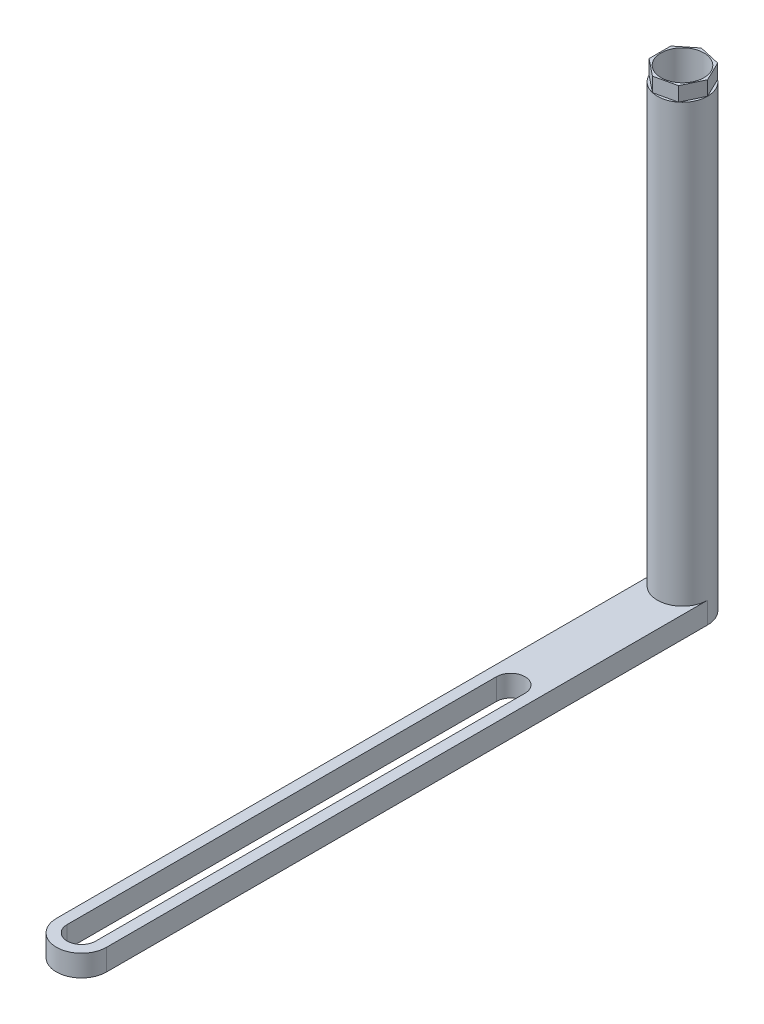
ISO-10303-21;
HEADER;
FILE_DESCRIPTION(('STEP AP214'),'2;1');
FILE_NAME('part.step','',(''),(''),'','','');
FILE_SCHEMA(('AUTOMOTIVE_DESIGN { 1 0 10303 214 1 1 1 1 }'));
ENDSEC;
DATA;
#1=APPLICATION_CONTEXT('core data for automotive mechanical design processes');
#2=APPLICATION_PROTOCOL_DEFINITION('international standard','automotive_design',2000,#1);
#3=PRODUCT_CONTEXT('',#1,'mechanical');
#4=PRODUCT('Part','Part','',(#3));
#5=PRODUCT_RELATED_PRODUCT_CATEGORY('part','',(#4));
#6=PRODUCT_DEFINITION_FORMATION('','',#4);
#7=PRODUCT_DEFINITION_CONTEXT('part definition',#1,'design');
#8=PRODUCT_DEFINITION('design','',#6,#7);
#9=PRODUCT_DEFINITION_SHAPE('','',#8);
#10=(LENGTH_UNIT() NAMED_UNIT(*) SI_UNIT(.MILLI.,.METRE.));
#11=(NAMED_UNIT(*) PLANE_ANGLE_UNIT() SI_UNIT($,.RADIAN.));
#12=(NAMED_UNIT(*) SI_UNIT($,.STERADIAN.) SOLID_ANGLE_UNIT());
#13=UNCERTAINTY_MEASURE_WITH_UNIT(LENGTH_MEASURE(1.E-05),#10,'distance_accuracy_value','');
#14=(GEOMETRIC_REPRESENTATION_CONTEXT(3) GLOBAL_UNCERTAINTY_ASSIGNED_CONTEXT((#13)) GLOBAL_UNIT_ASSIGNED_CONTEXT((#10,
#11,#12)) REPRESENTATION_CONTEXT('',''));
#15=CARTESIAN_POINT('',(0.,0.,0.));
#16=DIRECTION('',(0.,0.,1.));
#17=DIRECTION('',(1.,0.,0.));
#18=AXIS2_PLACEMENT_3D('',#15,#16,#17);
#19=CARTESIAN_POINT('',(0.,33.,0.));
#20=DIRECTION('',(0.,-1.,0.));
#21=DIRECTION('',(0.,0.,-1.));
#22=AXIS2_PLACEMENT_3D('',#19,#20,#21);
#23=CYLINDRICAL_SURFACE('',#22,1.75);
#24=CARTESIAN_POINT('',(0.,1.5,0.));
#25=DIRECTION('',(0.,-1.,0.));
#26=DIRECTION('',(0.,0.,-1.));
#27=AXIS2_PLACEMENT_3D('',#24,#25,#26);
#28=CIRCLE('',#27,1.75);
#29=CARTESIAN_POINT('',(1.75,1.5,0.));
#30=VERTEX_POINT('',#29);
#31=CARTESIAN_POINT('',(-1.75,1.5,0.));
#32=VERTEX_POINT('',#31);
#33=EDGE_CURVE('E61',#30,#32,#28,.T.);
#34=ORIENTED_EDGE('',*,*,#33,.F.);
#35=DIRECTION('',(0.,-1.,0.));
#36=VECTOR('',#35,1.);
#37=CARTESIAN_POINT('',(1.75,1.5,0.));
#38=LINE('',#37,#36);
#39=CARTESIAN_POINT('',(1.75,0.,0.));
#40=VERTEX_POINT('',#39);
#41=EDGE_CURVE('E236',#30,#40,#38,.T.);
#42=ORIENTED_EDGE('',*,*,#41,.T.);
#43=CARTESIAN_POINT('',(0.,0.,0.));
#44=DIRECTION('',(0.,1.,0.));
#45=DIRECTION('',(0.,0.,1.));
#46=AXIS2_PLACEMENT_3D('',#43,#44,#45);
#47=CIRCLE('',#46,1.75);
#48=CARTESIAN_POINT('',(-1.75,0.,0.));
#49=VERTEX_POINT('',#48);
#50=EDGE_CURVE('E12',#40,#49,#47,.T.);
#51=ORIENTED_EDGE('',*,*,#50,.T.);
#52=DIRECTION('',(0.,-1.,0.));
#53=VECTOR('',#52,1.);
#54=CARTESIAN_POINT('',(-1.75,1.5,0.));
#55=LINE('',#54,#53);
#56=EDGE_CURVE('E65',#32,#49,#55,.T.);
#57=ORIENTED_EDGE('',*,*,#56,.F.);
#58=EDGE_LOOP('',(#34,#42,#51,#57));
#59=FACE_BOUND('',#58,.T.);
#60=CARTESIAN_POINT('',(0.,32.,0.));
#61=DIRECTION('',(0.,1.,0.));
#62=DIRECTION('',(0.,0.,1.));
#63=AXIS2_PLACEMENT_3D('',#60,#61,#62);
#64=CIRCLE('',#63,1.75);
#65=CARTESIAN_POINT('',(-1.57669551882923,32.,-0.759296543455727));
#66=VERTEX_POINT('',#65);
#67=CARTESIAN_POINT('',(-1.57669551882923,32.,0.759296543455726));
#68=VERTEX_POINT('',#67);
#69=EDGE_CURVE('E168',#66,#68,#64,.T.);
#70=ORIENTED_EDGE('',*,*,#69,.F.);
#71=CARTESIAN_POINT('',(0.,32.,0.));
#72=DIRECTION('',(0.,1.,0.));
#73=DIRECTION('',(0.,0.,1.));
#74=AXIS2_PLACEMENT_3D('',#71,#72,#73);
#75=CIRCLE('',#74,1.75);
#76=CARTESIAN_POINT('',(-0.389411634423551,32.,-1.70612384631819));
#77=VERTEX_POINT('',#76);
#78=EDGE_CURVE('E176',#77,#66,#75,.T.);
#79=ORIENTED_EDGE('',*,*,#78,.F.);
#80=CARTESIAN_POINT('',(0.,32.,0.));
#81=DIRECTION('',(0.,1.,0.));
#82=DIRECTION('',(0.,0.,1.));
#83=AXIS2_PLACEMENT_3D('',#80,#81,#82);
#84=CIRCLE('',#83,1.75);
#85=CARTESIAN_POINT('',(1.09110715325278,32.,-1.36820509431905));
#86=VERTEX_POINT('',#85);
#87=EDGE_CURVE('E284',#86,#77,#84,.T.);
#88=ORIENTED_EDGE('',*,*,#87,.F.);
#89=CARTESIAN_POINT('',(0.,32.,0.));
#90=DIRECTION('',(0.,1.,0.));
#91=DIRECTION('',(0.,0.,1.));
#92=AXIS2_PLACEMENT_3D('',#89,#90,#91);
#93=CIRCLE('',#92,1.75);
#94=CARTESIAN_POINT('',(1.75,32.,0.));
#95=VERTEX_POINT('',#94);
#96=EDGE_CURVE('E287',#95,#86,#93,.T.);
#97=ORIENTED_EDGE('',*,*,#96,.F.);
#98=CARTESIAN_POINT('',(0.,32.,0.));
#99=DIRECTION('',(0.,1.,0.));
#100=DIRECTION('',(0.,0.,1.));
#101=AXIS2_PLACEMENT_3D('',#98,#99,#100);
#102=CIRCLE('',#101,1.75);
#103=CARTESIAN_POINT('',(1.09110715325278,32.,1.36820509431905));
#104=VERTEX_POINT('',#103);
#105=EDGE_CURVE('E297',#104,#95,#102,.T.);
#106=ORIENTED_EDGE('',*,*,#105,.F.);
#107=CARTESIAN_POINT('',(0.,32.,0.));
#108=DIRECTION('',(0.,1.,0.));
#109=DIRECTION('',(0.,0.,1.));
#110=AXIS2_PLACEMENT_3D('',#107,#108,#109);
#111=CIRCLE('',#110,1.75);
#112=CARTESIAN_POINT('',(-0.38941163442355,32.,1.70612384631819));
#113=VERTEX_POINT('',#112);
#114=EDGE_CURVE('E316',#113,#104,#111,.T.);
#115=ORIENTED_EDGE('',*,*,#114,.F.);
#116=CARTESIAN_POINT('',(0.,32.,0.));
#117=DIRECTION('',(0.,1.,0.));
#118=DIRECTION('',(0.,0.,1.));
#119=AXIS2_PLACEMENT_3D('',#116,#117,#118);
#120=CIRCLE('',#119,1.75);
#121=EDGE_CURVE('E178',#68,#113,#120,.T.);
#122=ORIENTED_EDGE('',*,*,#121,.F.);
#123=EDGE_LOOP('',(#70,#79,#88,#97,#106,#115,#122));
#124=FACE_BOUND('',#123,.T.);
#125=ADVANCED_FACE('F47',(#59,#124),#23,.T.);
#126=CARTESIAN_POINT('',(0.,33.,0.));
#127=DIRECTION('',(0.,1.,0.));
#128=DIRECTION('',(0.,0.,1.));
#129=AXIS2_PLACEMENT_3D('',#126,#127,#128);
#130=PLANE('',#129);
#131=CARTESIAN_POINT('',(0.,33.,0.));
#132=DIRECTION('',(0.,1.,0.));
#133=DIRECTION('',(0.,0.,1.));
#134=AXIS2_PLACEMENT_3D('',#131,#132,#133);
#135=CIRCLE('',#134,1.5);
#136=CARTESIAN_POINT('',(0.,33.,1.5));
#137=VERTEX_POINT('',#136);
#138=EDGE_CURVE('E54',#137,#137,#135,.T.);
#139=ORIENTED_EDGE('',*,*,#138,.F.);
#140=EDGE_LOOP('',(#139));
#141=FACE_BOUND('',#140,.T.);
#142=DIRECTION('',(-0.781831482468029,0.,0.623489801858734));
#143=VECTOR('',#142,1.);
#144=CARTESIAN_POINT('',(-0.983053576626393,33.,-1.23271019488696));
#145=LINE('',#144,#143);
#146=CARTESIAN_POINT('',(-0.389411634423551,33.,-1.70612384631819));
#147=VERTEX_POINT('',#146);
#148=CARTESIAN_POINT('',(-1.57669551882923,33.,-0.759296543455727));
#149=VERTEX_POINT('',#148);
#150=EDGE_CURVE('E185',#147,#149,#145,.T.);
#151=ORIENTED_EDGE('',*,*,#150,.T.);
#152=DIRECTION('',(0.,0.,1.));
#153=VECTOR('',#152,1.);
#154=CARTESIAN_POINT('',(-1.57669551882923,33.,0.));
#155=LINE('',#154,#153);
#156=CARTESIAN_POINT('',(-1.57669551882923,33.,0.759296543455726));
#157=VERTEX_POINT('',#156);
#158=EDGE_CURVE('E157',#149,#157,#155,.T.);
#159=ORIENTED_EDGE('',*,*,#158,.T.);
#160=DIRECTION('',(0.78183148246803,0.,0.623489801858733));
#161=VECTOR('',#160,1.);
#162=CARTESIAN_POINT('',(-0.983053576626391,33.,1.23271019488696));
#163=LINE('',#162,#161);
#164=CARTESIAN_POINT('',(-0.38941163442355,33.,1.70612384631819));
#165=VERTEX_POINT('',#164);
#166=EDGE_CURVE('E169',#157,#165,#163,.T.);
#167=ORIENTED_EDGE('',*,*,#166,.T.);
#168=DIRECTION('',(0.974927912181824,0.,-0.222520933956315));
#169=VECTOR('',#168,1.);
#170=CARTESIAN_POINT('',(0.350847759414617,33.,1.53716447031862));
#171=LINE('',#170,#169);
#172=CARTESIAN_POINT('',(1.09110715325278,33.,1.36820509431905));
#173=VERTEX_POINT('',#172);
#174=EDGE_CURVE('E319',#165,#173,#171,.T.);
#175=ORIENTED_EDGE('',*,*,#174,.T.);
#176=DIRECTION('',(0.433883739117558,0.,-0.900968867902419));
#177=VECTOR('',#176,1.);
#178=CARTESIAN_POINT('',(1.42055357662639,33.,0.684102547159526));
#179=LINE('',#178,#177);
#180=CARTESIAN_POINT('',(1.75,33.,0.));
#181=VERTEX_POINT('',#180);
#182=EDGE_CURVE('E310',#173,#181,#179,.T.);
#183=ORIENTED_EDGE('',*,*,#182,.T.);
#184=DIRECTION('',(-0.433883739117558,0.,-0.900968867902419));
#185=VECTOR('',#184,1.);
#186=CARTESIAN_POINT('',(1.42055357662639,33.,-0.684102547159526));
#187=LINE('',#186,#185);
#188=CARTESIAN_POINT('',(1.09110715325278,33.,-1.36820509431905));
#189=VERTEX_POINT('',#188);
#190=EDGE_CURVE('E278',#181,#189,#187,.T.);
#191=ORIENTED_EDGE('',*,*,#190,.T.);
#192=DIRECTION('',(-0.974927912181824,0.,-0.222520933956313));
#193=VECTOR('',#192,1.);
#194=CARTESIAN_POINT('',(0.350847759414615,33.,-1.53716447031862));
#195=LINE('',#194,#193);
#196=EDGE_CURVE('E275',#189,#147,#195,.T.);
#197=ORIENTED_EDGE('',*,*,#196,.T.);
#198=EDGE_LOOP('',(#151,#159,#167,#175,#183,#191,#197));
#199=FACE_BOUND('',#198,.T.);
#200=ADVANCED_FACE('F266',(#141,#199),#130,.T.);
#201=CARTESIAN_POINT('',(0.,0.,0.));
#202=DIRECTION('',(0.,1.,0.));
#203=DIRECTION('',(0.,0.,1.));
#204=AXIS2_PLACEMENT_3D('',#201,#202,#203);
#205=PLANE('',#204);
#206=ORIENTED_EDGE('',*,*,#50,.F.);
#207=DIRECTION('',(0.,0.,1.));
#208=VECTOR('',#207,1.);
#209=CARTESIAN_POINT('',(1.75,0.,0.));
#210=LINE('',#209,#208);
#211=CARTESIAN_POINT('',(1.75,0.,42.));
#212=VERTEX_POINT('',#211);
#213=EDGE_CURVE('E219',#40,#212,#210,.T.);
#214=ORIENTED_EDGE('',*,*,#213,.T.);
#215=CARTESIAN_POINT('',(0.,0.,42.));
#216=DIRECTION('',(0.,-1.,0.));
#217=DIRECTION('',(0.,0.,-1.));
#218=AXIS2_PLACEMENT_3D('',#215,#216,#217);
#219=CIRCLE('',#218,1.75);
#220=CARTESIAN_POINT('',(-1.75,0.,42.));
#221=VERTEX_POINT('',#220);
#222=EDGE_CURVE('E239',#212,#221,#219,.T.);
#223=ORIENTED_EDGE('',*,*,#222,.T.);
#224=DIRECTION('',(0.,0.,-1.));
#225=VECTOR('',#224,1.);
#226=CARTESIAN_POINT('',(-1.75,0.,0.));
#227=LINE('',#226,#225);
#228=EDGE_CURVE('E230',#221,#49,#227,.T.);
#229=ORIENTED_EDGE('',*,*,#228,.T.);
#230=EDGE_LOOP('',(#206,#214,#223,#229));
#231=FACE_BOUND('',#230,.T.);
#232=CARTESIAN_POINT('',(0.,0.,0.));
#233=DIRECTION('',(0.,1.,0.));
#234=DIRECTION('',(0.,0.,1.));
#235=AXIS2_PLACEMENT_3D('',#232,#233,#234);
#236=CIRCLE('',#235,1.5);
#237=CARTESIAN_POINT('',(0.,0.,1.5));
#238=VERTEX_POINT('',#237);
#239=EDGE_CURVE('E251',#238,#238,#236,.T.);
#240=ORIENTED_EDGE('',*,*,#239,.T.);
#241=EDGE_LOOP('',(#240));
#242=FACE_BOUND('',#241,.T.);
#243=CARTESIAN_POINT('',(0.,0.,42.));
#244=DIRECTION('',(0.,-1.,0.));
#245=DIRECTION('',(0.,0.,-1.));
#246=AXIS2_PLACEMENT_3D('',#243,#244,#245);
#247=CIRCLE('',#246,1.);
#248=CARTESIAN_POINT('',(1.,0.,42.));
#249=VERTEX_POINT('',#248);
#250=CARTESIAN_POINT('',(-1.,0.,42.));
#251=VERTEX_POINT('',#250);
#252=EDGE_CURVE('E162',#249,#251,#247,.T.);
#253=ORIENTED_EDGE('',*,*,#252,.F.);
#254=DIRECTION('',(0.,0.,1.));
#255=VECTOR('',#254,1.);
#256=CARTESIAN_POINT('',(1.,0.,42.));
#257=LINE('',#256,#255);
#258=CARTESIAN_POINT('',(1.,0.,12.));
#259=VERTEX_POINT('',#258);
#260=EDGE_CURVE('E198',#259,#249,#257,.T.);
#261=ORIENTED_EDGE('',*,*,#260,.F.);
#262=CARTESIAN_POINT('',(0.,0.,12.));
#263=DIRECTION('',(0.,-1.,0.));
#264=DIRECTION('',(0.,0.,-1.));
#265=AXIS2_PLACEMENT_3D('',#262,#263,#264);
#266=CIRCLE('',#265,1.);
#267=CARTESIAN_POINT('',(-0.999999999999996,0.,12.));
#268=VERTEX_POINT('',#267);
#269=EDGE_CURVE('E212',#268,#259,#266,.T.);
#270=ORIENTED_EDGE('',*,*,#269,.F.);
#271=DIRECTION('',(0.,0.,-1.));
#272=VECTOR('',#271,1.);
#273=CARTESIAN_POINT('',(-1.,0.,42.));
#274=LINE('',#273,#272);
#275=EDGE_CURVE('E209',#251,#268,#274,.T.);
#276=ORIENTED_EDGE('',*,*,#275,.F.);
#277=EDGE_LOOP('',(#253,#261,#270,#276));
#278=FACE_BOUND('',#277,.T.);
#279=ADVANCED_FACE('F256',(#231,#242,#278),#205,.F.);
#280=CARTESIAN_POINT('',(0.,33.,0.));
#281=DIRECTION('',(0.,-1.,0.));
#282=DIRECTION('',(0.,0.,-1.));
#283=AXIS2_PLACEMENT_3D('',#280,#281,#282);
#284=CYLINDRICAL_SURFACE('',#283,1.5);
#285=ORIENTED_EDGE('',*,*,#239,.F.);
#286=EDGE_LOOP('',(#285));
#287=FACE_BOUND('',#286,.T.);
#288=ORIENTED_EDGE('',*,*,#138,.T.);
#289=EDGE_LOOP('',(#288));
#290=FACE_BOUND('',#289,.T.);
#291=ADVANCED_FACE('F259',(#287,#290),#284,.F.);
#292=CARTESIAN_POINT('',(0.,1.5,0.));
#293=DIRECTION('',(0.,-1.,0.));
#294=DIRECTION('',(0.,0.,-1.));
#295=AXIS2_PLACEMENT_3D('',#292,#293,#294);
#296=PLANE('',#295);
#297=DIRECTION('',(0.,0.,1.));
#298=VECTOR('',#297,1.);
#299=CARTESIAN_POINT('',(1.,1.5,42.));
#300=LINE('',#299,#298);
#301=CARTESIAN_POINT('',(1.,1.5,12.));
#302=VERTEX_POINT('',#301);
#303=CARTESIAN_POINT('',(1.,1.5,42.));
#304=VERTEX_POINT('',#303);
#305=EDGE_CURVE('E204',#302,#304,#300,.T.);
#306=ORIENTED_EDGE('',*,*,#305,.T.);
#307=CARTESIAN_POINT('',(0.,1.5,42.));
#308=DIRECTION('',(0.,-1.,0.));
#309=DIRECTION('',(0.,0.,-1.));
#310=AXIS2_PLACEMENT_3D('',#307,#308,#309);
#311=CIRCLE('',#310,1.);
#312=CARTESIAN_POINT('',(-1.,1.5,42.));
#313=VERTEX_POINT('',#312);
#314=EDGE_CURVE('E194',#304,#313,#311,.T.);
#315=ORIENTED_EDGE('',*,*,#314,.T.);
#316=DIRECTION('',(0.,0.,-1.));
#317=VECTOR('',#316,1.);
#318=CARTESIAN_POINT('',(-1.,1.5,42.));
#319=LINE('',#318,#317);
#320=CARTESIAN_POINT('',(-0.999999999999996,1.5,12.));
#321=VERTEX_POINT('',#320);
#322=EDGE_CURVE('E197',#313,#321,#319,.T.);
#323=ORIENTED_EDGE('',*,*,#322,.T.);
#324=CARTESIAN_POINT('',(0.,1.5,12.));
#325=DIRECTION('',(0.,-1.,0.));
#326=DIRECTION('',(0.,0.,-1.));
#327=AXIS2_PLACEMENT_3D('',#324,#325,#326);
#328=CIRCLE('',#327,1.);
#329=EDGE_CURVE('E201',#321,#302,#328,.T.);
#330=ORIENTED_EDGE('',*,*,#329,.T.);
#331=EDGE_LOOP('',(#306,#315,#323,#330));
#332=FACE_BOUND('',#331,.T.);
#333=DIRECTION('',(0.,0.,1.));
#334=VECTOR('',#333,1.);
#335=CARTESIAN_POINT('',(1.75,1.5,0.));
#336=LINE('',#335,#334);
#337=CARTESIAN_POINT('',(1.75,1.5,42.));
#338=VERTEX_POINT('',#337);
#339=EDGE_CURVE('E226',#30,#338,#336,.T.);
#340=ORIENTED_EDGE('',*,*,#339,.F.);
#341=ORIENTED_EDGE('',*,*,#33,.T.);
#342=DIRECTION('',(0.,0.,-1.));
#343=VECTOR('',#342,1.);
#344=CARTESIAN_POINT('',(-1.75,1.5,0.));
#345=LINE('',#344,#343);
#346=CARTESIAN_POINT('',(-1.75,1.5,42.));
#347=VERTEX_POINT('',#346);
#348=EDGE_CURVE('E233',#347,#32,#345,.T.);
#349=ORIENTED_EDGE('',*,*,#348,.F.);
#350=CARTESIAN_POINT('',(0.,1.5,42.));
#351=DIRECTION('',(0.,-1.,0.));
#352=DIRECTION('',(0.,0.,-1.));
#353=AXIS2_PLACEMENT_3D('',#350,#351,#352);
#354=CIRCLE('',#353,1.75);
#355=EDGE_CURVE('E229',#338,#347,#354,.T.);
#356=ORIENTED_EDGE('',*,*,#355,.F.);
#357=EDGE_LOOP('',(#340,#341,#349,#356));
#358=FACE_BOUND('',#357,.T.);
#359=ADVANCED_FACE('F262',(#332,#358),#296,.F.);
#360=CARTESIAN_POINT('',(-1.75,1.5,0.));
#361=DIRECTION('',(-1.,0.,0.));
#362=DIRECTION('',(0.,0.,1.));
#363=AXIS2_PLACEMENT_3D('',#360,#361,#362);
#364=PLANE('',#363);
#365=ORIENTED_EDGE('',*,*,#228,.F.);
#366=DIRECTION('',(0.,-1.,0.));
#367=VECTOR('',#366,1.);
#368=CARTESIAN_POINT('',(-1.75,1.5,42.));
#369=LINE('',#368,#367);
#370=EDGE_CURVE('E245',#347,#221,#369,.T.);
#371=ORIENTED_EDGE('',*,*,#370,.F.);
#372=ORIENTED_EDGE('',*,*,#348,.T.);
#373=ORIENTED_EDGE('',*,*,#56,.T.);
#374=EDGE_LOOP('',(#365,#371,#372,#373));
#375=FACE_BOUND('',#374,.T.);
#376=ADVANCED_FACE('F371',(#375),#364,.T.);
#377=CARTESIAN_POINT('',(0.,1.5,42.));
#378=DIRECTION('',(0.,-1.,0.));
#379=DIRECTION('',(0.,0.,-1.));
#380=AXIS2_PLACEMENT_3D('',#377,#378,#379);
#381=CYLINDRICAL_SURFACE('',#380,1.75);
#382=ORIENTED_EDGE('',*,*,#222,.F.);
#383=DIRECTION('',(0.,-1.,0.));
#384=VECTOR('',#383,1.);
#385=CARTESIAN_POINT('',(1.75,1.5,42.));
#386=LINE('',#385,#384);
#387=EDGE_CURVE('E247',#338,#212,#386,.T.);
#388=ORIENTED_EDGE('',*,*,#387,.F.);
#389=ORIENTED_EDGE('',*,*,#355,.T.);
#390=ORIENTED_EDGE('',*,*,#370,.T.);
#391=EDGE_LOOP('',(#382,#388,#389,#390));
#392=FACE_BOUND('',#391,.T.);
#393=ADVANCED_FACE('F379',(#392),#381,.T.);
#394=CARTESIAN_POINT('',(1.75,1.5,0.));
#395=DIRECTION('',(1.,0.,0.));
#396=DIRECTION('',(0.,0.,-1.));
#397=AXIS2_PLACEMENT_3D('',#394,#395,#396);
#398=PLANE('',#397);
#399=ORIENTED_EDGE('',*,*,#213,.F.);
#400=ORIENTED_EDGE('',*,*,#41,.F.);
#401=ORIENTED_EDGE('',*,*,#339,.T.);
#402=ORIENTED_EDGE('',*,*,#387,.T.);
#403=EDGE_LOOP('',(#399,#400,#401,#402));
#404=FACE_BOUND('',#403,.T.);
#405=ADVANCED_FACE('F387',(#404),#398,.T.);
#406=CARTESIAN_POINT('',(0.,1.5,42.));
#407=DIRECTION('',(0.,-1.,0.));
#408=DIRECTION('',(0.,0.,-1.));
#409=AXIS2_PLACEMENT_3D('',#406,#407,#408);
#410=CYLINDRICAL_SURFACE('',#409,1.);
#411=ORIENTED_EDGE('',*,*,#252,.T.);
#412=DIRECTION('',(0.,-1.,0.));
#413=VECTOR('',#412,1.);
#414=CARTESIAN_POINT('',(-1.,1.5,42.));
#415=LINE('',#414,#413);
#416=EDGE_CURVE('E207',#313,#251,#415,.T.);
#417=ORIENTED_EDGE('',*,*,#416,.F.);
#418=ORIENTED_EDGE('',*,*,#314,.F.);
#419=DIRECTION('',(0.,-1.,0.));
#420=VECTOR('',#419,1.);
#421=CARTESIAN_POINT('',(1.,1.5,42.));
#422=LINE('',#421,#420);
#423=EDGE_CURVE('E217',#304,#249,#422,.T.);
#424=ORIENTED_EDGE('',*,*,#423,.T.);
#425=EDGE_LOOP('',(#411,#417,#418,#424));
#426=FACE_BOUND('',#425,.T.);
#427=ADVANCED_FACE('F395',(#426),#410,.F.);
#428=CARTESIAN_POINT('',(1.,1.5,42.));
#429=DIRECTION('',(1.,0.,0.));
#430=DIRECTION('',(0.,0.,-1.));
#431=AXIS2_PLACEMENT_3D('',#428,#429,#430);
#432=PLANE('',#431);
#433=ORIENTED_EDGE('',*,*,#260,.T.);
#434=ORIENTED_EDGE('',*,*,#423,.F.);
#435=ORIENTED_EDGE('',*,*,#305,.F.);
#436=DIRECTION('',(0.,-1.,0.));
#437=VECTOR('',#436,1.);
#438=CARTESIAN_POINT('',(1.,1.5,12.));
#439=LINE('',#438,#437);
#440=EDGE_CURVE('E220',#302,#259,#439,.T.);
#441=ORIENTED_EDGE('',*,*,#440,.T.);
#442=EDGE_LOOP('',(#433,#434,#435,#441));
#443=FACE_BOUND('',#442,.T.);
#444=ADVANCED_FACE('F403',(#443),#432,.F.);
#445=CARTESIAN_POINT('',(0.,1.5,12.));
#446=DIRECTION('',(0.,-1.,0.));
#447=DIRECTION('',(0.,0.,-1.));
#448=AXIS2_PLACEMENT_3D('',#445,#446,#447);
#449=CYLINDRICAL_SURFACE('',#448,1.);
#450=ORIENTED_EDGE('',*,*,#269,.T.);
#451=ORIENTED_EDGE('',*,*,#440,.F.);
#452=ORIENTED_EDGE('',*,*,#329,.F.);
#453=DIRECTION('',(0.,-1.,0.));
#454=VECTOR('',#453,1.);
#455=CARTESIAN_POINT('',(-0.999999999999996,1.5,12.));
#456=LINE('',#455,#454);
#457=EDGE_CURVE('E222',#321,#268,#456,.T.);
#458=ORIENTED_EDGE('',*,*,#457,.T.);
#459=EDGE_LOOP('',(#450,#451,#452,#458));
#460=FACE_BOUND('',#459,.T.);
#461=ADVANCED_FACE('F411',(#460),#449,.F.);
#462=CARTESIAN_POINT('',(-1.,1.5,42.));
#463=DIRECTION('',(-1.,0.,0.));
#464=DIRECTION('',(0.,0.,1.));
#465=AXIS2_PLACEMENT_3D('',#462,#463,#464);
#466=PLANE('',#465);
#467=ORIENTED_EDGE('',*,*,#275,.T.);
#468=ORIENTED_EDGE('',*,*,#457,.F.);
#469=ORIENTED_EDGE('',*,*,#322,.F.);
#470=ORIENTED_EDGE('',*,*,#416,.T.);
#471=EDGE_LOOP('',(#467,#468,#469,#470));
#472=FACE_BOUND('',#471,.T.);
#473=ADVANCED_FACE('F419',(#472),#466,.F.);
#474=CARTESIAN_POINT('',(-0.983053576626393,32.,-1.23271019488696));
#475=DIRECTION('',(-0.623489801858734,0.,-0.781831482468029));
#476=DIRECTION('',(-0.781831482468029,0.,0.623489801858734));
#477=AXIS2_PLACEMENT_3D('',#474,#475,#476);
#478=PLANE('',#477);
#479=ORIENTED_EDGE('',*,*,#150,.F.);
#480=DIRECTION('',(0.,1.,0.));
#481=VECTOR('',#480,1.);
#482=CARTESIAN_POINT('',(-0.389411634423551,32.,-1.70612384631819));
#483=LINE('',#482,#481);
#484=EDGE_CURVE('E163',#77,#147,#483,.T.);
#485=ORIENTED_EDGE('',*,*,#484,.F.);
#486=DIRECTION('',(-0.781831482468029,0.,0.623489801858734));
#487=VECTOR('',#486,1.);
#488=CARTESIAN_POINT('',(-0.983053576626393,32.,-1.23271019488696));
#489=LINE('',#488,#487);
#490=EDGE_CURVE('E182',#77,#66,#489,.T.);
#491=ORIENTED_EDGE('',*,*,#490,.T.);
#492=DIRECTION('',(0.,1.,0.));
#493=VECTOR('',#492,1.);
#494=CARTESIAN_POINT('',(-1.57669551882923,32.,-0.759296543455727));
#495=LINE('',#494,#493);
#496=EDGE_CURVE('E151',#66,#149,#495,.T.);
#497=ORIENTED_EDGE('',*,*,#496,.T.);
#498=EDGE_LOOP('',(#479,#485,#491,#497));
#499=FACE_BOUND('',#498,.T.);
#500=ADVANCED_FACE('F183',(#499),#478,.T.);
#501=CARTESIAN_POINT('',(0.,32.,0.));
#502=DIRECTION('',(0.,1.,0.));
#503=DIRECTION('',(0.,0.,1.));
#504=AXIS2_PLACEMENT_3D('',#501,#502,#503);
#505=PLANE('',#504);
#506=ORIENTED_EDGE('',*,*,#490,.F.);
#507=ORIENTED_EDGE('',*,*,#78,.T.);
#508=EDGE_LOOP('',(#506,#507));
#509=FACE_BOUND('',#508,.T.);
#510=ADVANCED_FACE('F187',(#509),#505,.T.);
#511=CARTESIAN_POINT('',(0.350847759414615,32.,-1.53716447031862));
#512=DIRECTION('',(0.222520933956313,0.,-0.974927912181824));
#513=DIRECTION('',(-0.974927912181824,0.,-0.222520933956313));
#514=AXIS2_PLACEMENT_3D('',#511,#512,#513);
#515=PLANE('',#514);
#516=ORIENTED_EDGE('',*,*,#196,.F.);
#517=DIRECTION('',(0.,1.,0.));
#518=VECTOR('',#517,1.);
#519=CARTESIAN_POINT('',(1.09110715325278,32.,-1.36820509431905));
#520=LINE('',#519,#518);
#521=EDGE_CURVE('E281',#86,#189,#520,.T.);
#522=ORIENTED_EDGE('',*,*,#521,.F.);
#523=DIRECTION('',(-0.974927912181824,0.,-0.222520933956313));
#524=VECTOR('',#523,1.);
#525=CARTESIAN_POINT('',(0.350847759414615,32.,-1.53716447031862));
#526=LINE('',#525,#524);
#527=EDGE_CURVE('E192',#86,#77,#526,.T.);
#528=ORIENTED_EDGE('',*,*,#527,.T.);
#529=ORIENTED_EDGE('',*,*,#484,.T.);
#530=EDGE_LOOP('',(#516,#522,#528,#529));
#531=FACE_BOUND('',#530,.T.);
#532=ADVANCED_FACE('F292',(#531),#515,.T.);
#533=CARTESIAN_POINT('',(0.,32.,0.));
#534=DIRECTION('',(0.,1.,0.));
#535=DIRECTION('',(0.,0.,1.));
#536=AXIS2_PLACEMENT_3D('',#533,#534,#535);
#537=PLANE('',#536);
#538=ORIENTED_EDGE('',*,*,#527,.F.);
#539=ORIENTED_EDGE('',*,*,#87,.T.);
#540=EDGE_LOOP('',(#538,#539));
#541=FACE_BOUND('',#540,.T.);
#542=ADVANCED_FACE('F294',(#541),#537,.T.);
#543=CARTESIAN_POINT('',(1.42055357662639,32.,-0.684102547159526));
#544=DIRECTION('',(0.900968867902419,0.,-0.433883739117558));
#545=DIRECTION('',(-0.433883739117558,0.,-0.900968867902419));
#546=AXIS2_PLACEMENT_3D('',#543,#544,#545);
#547=PLANE('',#546);
#548=ORIENTED_EDGE('',*,*,#190,.F.);
#549=DIRECTION('',(0.,1.,0.));
#550=VECTOR('',#549,1.);
#551=CARTESIAN_POINT('',(1.75,32.,0.));
#552=LINE('',#551,#550);
#553=EDGE_CURVE('E300',#95,#181,#552,.T.);
#554=ORIENTED_EDGE('',*,*,#553,.F.);
#555=DIRECTION('',(-0.433883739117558,0.,-0.900968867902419));
#556=VECTOR('',#555,1.);
#557=CARTESIAN_POINT('',(1.42055357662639,32.,-0.684102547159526));
#558=LINE('',#557,#556);
#559=EDGE_CURVE('E282',#95,#86,#558,.T.);
#560=ORIENTED_EDGE('',*,*,#559,.T.);
#561=ORIENTED_EDGE('',*,*,#521,.T.);
#562=EDGE_LOOP('',(#548,#554,#560,#561));
#563=FACE_BOUND('',#562,.T.);
#564=ADVANCED_FACE('F450',(#563),#547,.T.);
#565=CARTESIAN_POINT('',(0.,32.,0.));
#566=DIRECTION('',(0.,1.,0.));
#567=DIRECTION('',(0.,0.,1.));
#568=AXIS2_PLACEMENT_3D('',#565,#566,#567);
#569=PLANE('',#568);
#570=ORIENTED_EDGE('',*,*,#559,.F.);
#571=ORIENTED_EDGE('',*,*,#96,.T.);
#572=EDGE_LOOP('',(#570,#571));
#573=FACE_BOUND('',#572,.T.);
#574=ADVANCED_FACE('F457',(#573),#569,.T.);
#575=CARTESIAN_POINT('',(1.42055357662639,32.,0.684102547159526));
#576=DIRECTION('',(0.900968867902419,0.,0.433883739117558));
#577=DIRECTION('',(0.433883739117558,0.,-0.900968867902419));
#578=AXIS2_PLACEMENT_3D('',#575,#576,#577);
#579=PLANE('',#578);
#580=ORIENTED_EDGE('',*,*,#182,.F.);
#581=DIRECTION('',(0.,1.,0.));
#582=VECTOR('',#581,1.);
#583=CARTESIAN_POINT('',(1.09110715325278,32.,1.36820509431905));
#584=LINE('',#583,#582);
#585=EDGE_CURVE('E309',#104,#173,#584,.T.);
#586=ORIENTED_EDGE('',*,*,#585,.F.);
#587=DIRECTION('',(0.433883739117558,0.,-0.900968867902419));
#588=VECTOR('',#587,1.);
#589=CARTESIAN_POINT('',(1.42055357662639,32.,0.684102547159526));
#590=LINE('',#589,#588);
#591=EDGE_CURVE('E304',#104,#95,#590,.T.);
#592=ORIENTED_EDGE('',*,*,#591,.T.);
#593=ORIENTED_EDGE('',*,*,#553,.T.);
#594=EDGE_LOOP('',(#580,#586,#592,#593));
#595=FACE_BOUND('',#594,.T.);
#596=ADVANCED_FACE('F465',(#595),#579,.T.);
#597=CARTESIAN_POINT('',(0.,32.,0.));
#598=DIRECTION('',(0.,1.,0.));
#599=DIRECTION('',(0.,0.,1.));
#600=AXIS2_PLACEMENT_3D('',#597,#598,#599);
#601=PLANE('',#600);
#602=ORIENTED_EDGE('',*,*,#591,.F.);
#603=ORIENTED_EDGE('',*,*,#105,.T.);
#604=EDGE_LOOP('',(#602,#603));
#605=FACE_BOUND('',#604,.T.);
#606=ADVANCED_FACE('F472',(#605),#601,.T.);
#607=CARTESIAN_POINT('',(0.350847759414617,32.,1.53716447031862));
#608=DIRECTION('',(0.222520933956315,0.,0.974927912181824));
#609=DIRECTION('',(0.974927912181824,0.,-0.222520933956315));
#610=AXIS2_PLACEMENT_3D('',#607,#608,#609);
#611=PLANE('',#610);
#612=ORIENTED_EDGE('',*,*,#174,.F.);
#613=DIRECTION('',(0.,1.,0.));
#614=VECTOR('',#613,1.);
#615=CARTESIAN_POINT('',(-0.38941163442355,32.,1.70612384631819));
#616=LINE('',#615,#614);
#617=EDGE_CURVE('E318',#113,#165,#616,.T.);
#618=ORIENTED_EDGE('',*,*,#617,.F.);
#619=DIRECTION('',(0.974927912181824,0.,-0.222520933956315));
#620=VECTOR('',#619,1.);
#621=CARTESIAN_POINT('',(0.350847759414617,32.,1.53716447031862));
#622=LINE('',#621,#620);
#623=EDGE_CURVE('E312',#113,#104,#622,.T.);
#624=ORIENTED_EDGE('',*,*,#623,.T.);
#625=ORIENTED_EDGE('',*,*,#585,.T.);
#626=EDGE_LOOP('',(#612,#618,#624,#625));
#627=FACE_BOUND('',#626,.T.);
#628=ADVANCED_FACE('F480',(#627),#611,.T.);
#629=CARTESIAN_POINT('',(0.,32.,0.));
#630=DIRECTION('',(0.,1.,0.));
#631=DIRECTION('',(0.,0.,1.));
#632=AXIS2_PLACEMENT_3D('',#629,#630,#631);
#633=PLANE('',#632);
#634=ORIENTED_EDGE('',*,*,#623,.F.);
#635=ORIENTED_EDGE('',*,*,#114,.T.);
#636=EDGE_LOOP('',(#634,#635));
#637=FACE_BOUND('',#636,.T.);
#638=ADVANCED_FACE('F343',(#637),#633,.T.);
#639=CARTESIAN_POINT('',(-0.983053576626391,32.,1.23271019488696));
#640=DIRECTION('',(-0.623489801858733,0.,0.78183148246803));
#641=DIRECTION('',(0.78183148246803,0.,0.623489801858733));
#642=AXIS2_PLACEMENT_3D('',#639,#640,#641);
#643=PLANE('',#642);
#644=ORIENTED_EDGE('',*,*,#166,.F.);
#645=DIRECTION('',(0.,1.,0.));
#646=VECTOR('',#645,1.);
#647=CARTESIAN_POINT('',(-1.57669551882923,32.,0.759296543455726));
#648=LINE('',#647,#646);
#649=EDGE_CURVE('E327',#68,#157,#648,.T.);
#650=ORIENTED_EDGE('',*,*,#649,.F.);
#651=DIRECTION('',(0.78183148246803,0.,0.623489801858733));
#652=VECTOR('',#651,1.);
#653=CARTESIAN_POINT('',(-0.983053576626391,32.,1.23271019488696));
#654=LINE('',#653,#652);
#655=EDGE_CURVE('E322',#68,#113,#654,.T.);
#656=ORIENTED_EDGE('',*,*,#655,.T.);
#657=ORIENTED_EDGE('',*,*,#617,.T.);
#658=EDGE_LOOP('',(#644,#650,#656,#657));
#659=FACE_BOUND('',#658,.T.);
#660=ADVANCED_FACE('F332',(#659),#643,.T.);
#661=CARTESIAN_POINT('',(0.,32.,0.));
#662=DIRECTION('',(0.,1.,0.));
#663=DIRECTION('',(0.,0.,1.));
#664=AXIS2_PLACEMENT_3D('',#661,#662,#663);
#665=PLANE('',#664);
#666=ORIENTED_EDGE('',*,*,#655,.F.);
#667=ORIENTED_EDGE('',*,*,#121,.T.);
#668=EDGE_LOOP('',(#666,#667));
#669=FACE_BOUND('',#668,.T.);
#670=ADVANCED_FACE('F335',(#669),#665,.T.);
#671=CARTESIAN_POINT('',(-1.57669551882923,32.,0.));
#672=DIRECTION('',(-1.,0.,0.));
#673=DIRECTION('',(0.,0.,1.));
#674=AXIS2_PLACEMENT_3D('',#671,#672,#673);
#675=PLANE('',#674);
#676=ORIENTED_EDGE('',*,*,#158,.F.);
#677=ORIENTED_EDGE('',*,*,#496,.F.);
#678=DIRECTION('',(0.,0.,1.));
#679=VECTOR('',#678,1.);
#680=CARTESIAN_POINT('',(-1.57669551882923,32.,0.));
#681=LINE('',#680,#679);
#682=EDGE_CURVE('E154',#66,#68,#681,.T.);
#683=ORIENTED_EDGE('',*,*,#682,.T.);
#684=ORIENTED_EDGE('',*,*,#649,.T.);
#685=EDGE_LOOP('',(#676,#677,#683,#684));
#686=FACE_BOUND('',#685,.T.);
#687=ADVANCED_FACE('F153',(#686),#675,.T.);
#688=CARTESIAN_POINT('',(0.,32.,0.));
#689=DIRECTION('',(0.,1.,0.));
#690=DIRECTION('',(0.,0.,1.));
#691=AXIS2_PLACEMENT_3D('',#688,#689,#690);
#692=PLANE('',#691);
#693=ORIENTED_EDGE('',*,*,#682,.F.);
#694=ORIENTED_EDGE('',*,*,#69,.T.);
#695=EDGE_LOOP('',(#693,#694));
#696=FACE_BOUND('',#695,.T.);
#697=ADVANCED_FACE('F167',(#696),#692,.T.);
#698=CLOSED_SHELL('',(#125,#200,#279,#291,#359,#376,#393,#405,#427,#444,#461,#473,#500,#510,
#532,#542,#564,#574,#596,#606,#628,#638,#660,#670,#687,#697));
#699=MANIFOLD_SOLID_BREP('B2',#698);
#700=ADVANCED_BREP_SHAPE_REPRESENTATION('',(#18,#699),#14);
#701=SHAPE_DEFINITION_REPRESENTATION(#9,#700);
ENDSEC;
END-ISO-10303-21;
